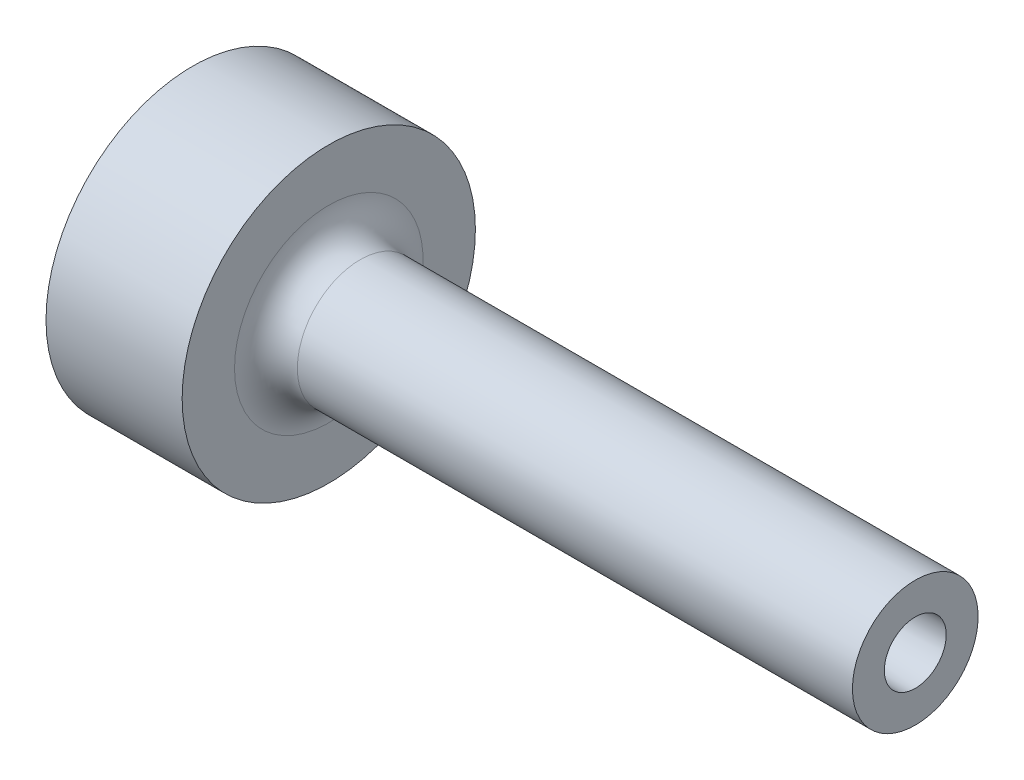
ISO-10303-21;
HEADER;
FILE_DESCRIPTION(('STEP AP214'),'2;1');
FILE_NAME('part.step','',(''),(''),'','','');
FILE_SCHEMA(('AUTOMOTIVE_DESIGN { 1 0 10303 214 1 1 1 1 }'));
ENDSEC;
DATA;
#1=APPLICATION_CONTEXT('core data for automotive mechanical design processes');
#2=APPLICATION_PROTOCOL_DEFINITION('international standard','automotive_design',2000,#1);
#3=PRODUCT_CONTEXT('',#1,'mechanical');
#4=PRODUCT('Part','Part','',(#3));
#5=PRODUCT_RELATED_PRODUCT_CATEGORY('part','',(#4));
#6=PRODUCT_DEFINITION_FORMATION('','',#4);
#7=PRODUCT_DEFINITION_CONTEXT('part definition',#1,'design');
#8=PRODUCT_DEFINITION('design','',#6,#7);
#9=PRODUCT_DEFINITION_SHAPE('','',#8);
#10=(LENGTH_UNIT() NAMED_UNIT(*) SI_UNIT(.MILLI.,.METRE.));
#11=(NAMED_UNIT(*) PLANE_ANGLE_UNIT() SI_UNIT($,.RADIAN.));
#12=(NAMED_UNIT(*) SI_UNIT($,.STERADIAN.) SOLID_ANGLE_UNIT());
#13=UNCERTAINTY_MEASURE_WITH_UNIT(LENGTH_MEASURE(1.E-05),#10,'distance_accuracy_value','');
#14=(GEOMETRIC_REPRESENTATION_CONTEXT(3) GLOBAL_UNCERTAINTY_ASSIGNED_CONTEXT((#13)) GLOBAL_UNIT_ASSIGNED_CONTEXT((#10,
#11,#12)) REPRESENTATION_CONTEXT('',''));
#15=CARTESIAN_POINT('',(0.,0.,0.));
#16=DIRECTION('',(0.,0.,1.));
#17=DIRECTION('',(1.,0.,0.));
#18=AXIS2_PLACEMENT_3D('',#15,#16,#17);
#19=CARTESIAN_POINT('',(0.,0.,0.));
#20=DIRECTION('',(-1.,0.,0.));
#21=DIRECTION('',(0.,0.,1.));
#22=AXIS2_PLACEMENT_3D('',#19,#20,#21);
#23=CYLINDRICAL_SURFACE('',#22,14.);
#24=CARTESIAN_POINT('',(13.,0.,0.));
#25=DIRECTION('',(-1.,0.,0.));
#26=DIRECTION('',(0.,0.,1.));
#27=AXIS2_PLACEMENT_3D('',#24,#25,#26);
#28=CIRCLE('',#27,14.);
#29=CARTESIAN_POINT('',(13.,0.,14.));
#30=VERTEX_POINT('',#29);
#31=EDGE_CURVE('E89',#30,#30,#28,.T.);
#32=ORIENTED_EDGE('',*,*,#31,.T.);
#33=EDGE_LOOP('',(#32));
#34=FACE_BOUND('',#33,.T.);
#35=CARTESIAN_POINT('',(0.,0.,0.));
#36=DIRECTION('',(-1.,0.,0.));
#37=DIRECTION('',(0.,0.,1.));
#38=AXIS2_PLACEMENT_3D('',#35,#36,#37);
#39=CIRCLE('',#38,14.);
#40=CARTESIAN_POINT('',(0.,0.,14.));
#41=VERTEX_POINT('',#40);
#42=EDGE_CURVE('E84',#41,#41,#39,.T.);
#43=ORIENTED_EDGE('',*,*,#42,.F.);
#44=EDGE_LOOP('',(#43));
#45=FACE_BOUND('',#44,.T.);
#46=CARTESIAN_POINT('',(6.5,-13.856406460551,-2.));
#47=CARTESIAN_POINT('',(6.61172417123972,-13.8564082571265,-1.99999534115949));
#48=CARTESIAN_POINT('',(6.72351471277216,-13.8577723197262,-1.99060664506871));
#49=CARTESIAN_POINT('',(6.9439746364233,-13.8630779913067,-1.95330740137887));
#50=CARTESIAN_POINT('',(7.05264079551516,-13.8670221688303,-1.92537839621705));
#51=CARTESIAN_POINT('',(7.26362870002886,-13.8770324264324,-1.85184738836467));
#52=CARTESIAN_POINT('',(7.36595507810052,-13.8830969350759,-1.80625847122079));
#53=CARTESIAN_POINT('',(7.56148972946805,-13.8966626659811,-1.69873175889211));
#54=CARTESIAN_POINT('',(7.65469934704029,-13.9041636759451,-1.63679637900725));
#55=CARTESIAN_POINT('',(7.83004829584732,-13.9198182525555,-1.49785346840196));
#56=CARTESIAN_POINT('',(7.91211171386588,-13.9279757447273,-1.42075056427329));
#57=CARTESIAN_POINT('',(8.06218155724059,-13.9439890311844,-1.25386707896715));
#58=CARTESIAN_POINT('',(8.13018723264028,-13.9518448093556,-1.16408582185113));
#59=CARTESIAN_POINT('',(8.25048909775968,-13.9664103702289,-0.973910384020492));
#60=CARTESIAN_POINT('',(8.30271571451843,-13.9731150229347,-0.873471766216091));
#61=CARTESIAN_POINT('',(8.38953073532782,-13.9845795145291,-0.665136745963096));
#62=CARTESIAN_POINT('',(8.4241199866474,-13.9893394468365,-0.557240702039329));
#63=CARTESIAN_POINT('',(8.47444920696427,-13.9963505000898,-0.337834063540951));
#64=CARTESIAN_POINT('',(8.49031606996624,-13.9986185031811,-0.226353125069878));
#65=CARTESIAN_POINT('',(8.5031438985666,-14.0004479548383,-0.00228956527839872));
#66=CARTESIAN_POINT('',(8.50010582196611,-14.0000095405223,0.110292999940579));
#67=CARTESIAN_POINT('',(8.47531062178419,-13.9964890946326,0.33249899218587));
#68=CARTESIAN_POINT('',(8.45369000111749,-13.9934263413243,0.442137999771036));
#69=CARTESIAN_POINT('',(8.39255744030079,-13.9850228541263,0.656215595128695));
#70=CARTESIAN_POINT('',(8.3530450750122,-13.9796820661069,0.760654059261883));
#71=CARTESIAN_POINT('',(8.25710925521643,-13.9672894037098,0.961781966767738));
#72=CARTESIAN_POINT('',(8.20062784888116,-13.9602316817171,1.05844339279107));
#73=CARTESIAN_POINT('',(8.07239950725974,-13.9451926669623,1.24096782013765));
#74=CARTESIAN_POINT('',(8.00065165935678,-13.9372113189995,1.32683017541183));
#75=CARTESIAN_POINT('',(7.843165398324,-13.921132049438,1.48612299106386));
#76=CARTESIAN_POINT('',(7.75730786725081,-13.9130337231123,1.55943569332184));
#77=CARTESIAN_POINT('',(7.57444547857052,-13.8977029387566,1.69062989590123));
#78=CARTESIAN_POINT('',(7.47744056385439,-13.890470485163,1.74851131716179));
#79=CARTESIAN_POINT('',(7.27491971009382,-13.8776905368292,1.84721301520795));
#80=CARTESIAN_POINT('',(7.1693981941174,-13.8721441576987,1.88802200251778));
#81=CARTESIAN_POINT('',(6.95290242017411,-13.8633846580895,1.9513062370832));
#82=CARTESIAN_POINT('',(6.84192850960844,-13.8601713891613,1.97378265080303));
#83=CARTESIAN_POINT('',(6.61872346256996,-13.8564698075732,1.99960390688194));
#84=CARTESIAN_POINT('',(6.50651197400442,-13.8559577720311,2.00311531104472));
#85=CARTESIAN_POINT('',(6.28310219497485,-13.8576537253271,1.9913480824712));
#86=CARTESIAN_POINT('',(6.17190387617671,-13.8598616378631,1.9760699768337));
#87=CARTESIAN_POINT('',(5.95418781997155,-13.8667269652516,1.92729837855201));
#88=CARTESIAN_POINT('',(5.84765127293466,-13.8713733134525,1.8938871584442));
#89=CARTESIAN_POINT('',(5.6416912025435,-13.8825829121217,1.80988306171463));
#90=CARTESIAN_POINT('',(5.54226800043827,-13.8891462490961,1.75928940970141));
#91=CARTESIAN_POINT('',(5.35260812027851,-13.9035064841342,1.64195360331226));
#92=CARTESIAN_POINT('',(5.26243903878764,-13.911311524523,1.57510320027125));
#93=CARTESIAN_POINT('',(5.09454027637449,-13.9272509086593,1.42730277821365));
#94=CARTESIAN_POINT('',(5.01681123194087,-13.9353852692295,1.34635203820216));
#95=CARTESIAN_POINT('',(4.8754047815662,-13.9511405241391,1.17191708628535));
#96=CARTESIAN_POINT('',(4.81183747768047,-13.9587570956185,1.07834317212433));
#97=CARTESIAN_POINT('',(4.70132443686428,-13.972552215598,0.881748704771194));
#98=CARTESIAN_POINT('',(4.65437828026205,-13.9787308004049,0.778728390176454));
#99=CARTESIAN_POINT('',(4.57861788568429,-13.9889347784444,0.566515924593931));
#100=CARTESIAN_POINT('',(4.54974241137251,-13.9929674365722,0.457345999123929));
#101=CARTESIAN_POINT('',(4.51074453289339,-13.9984555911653,0.235645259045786));
#102=CARTESIAN_POINT('',(4.50062101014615,-13.9999112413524,0.123114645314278));
#103=CARTESIAN_POINT('',(4.49943976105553,-14.0000800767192,-0.101043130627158));
#104=CARTESIAN_POINT('',(4.50821318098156,-13.998817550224,-0.212669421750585));
#105=CARTESIAN_POINT('',(4.54421615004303,-13.9937406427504,-0.432842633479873));
#106=CARTESIAN_POINT('',(4.57144565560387,-13.989926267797,-0.541389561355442));
#107=CARTESIAN_POINT('',(4.6435299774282,-13.9801722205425,-0.752283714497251));
#108=CARTESIAN_POINT('',(4.68837418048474,-13.9742338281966,-0.854634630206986));
#109=CARTESIAN_POINT('',(4.79439714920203,-13.960885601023,-1.05038570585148));
#110=CARTESIAN_POINT('',(4.8555763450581,-13.9534757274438,-1.14378562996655));
#111=CARTESIAN_POINT('',(4.99314771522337,-13.9379304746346,-1.31984194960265));
#112=CARTESIAN_POINT('',(5.06966490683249,-13.9297894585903,-1.40240016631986));
#113=CARTESIAN_POINT('',(5.2354775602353,-13.9137422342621,-1.55356716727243));
#114=CARTESIAN_POINT('',(5.32477602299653,-13.9058360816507,-1.6221726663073));
#115=CARTESIAN_POINT('',(5.51414543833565,-13.8911108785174,-1.74379523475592));
#116=CARTESIAN_POINT('',(5.61426869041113,-13.8842975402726,-1.79673154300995));
#117=CARTESIAN_POINT('',(5.82203229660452,-13.8725962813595,-1.88495902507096));
#118=CARTESIAN_POINT('',(5.92966459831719,-13.8677063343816,-1.92026877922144));
#119=CARTESIAN_POINT('',(6.11483642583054,-13.8615529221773,-1.96409255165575));
#120=CARTESIAN_POINT('',(6.19122433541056,-13.859633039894,-1.97753762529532));
#121=CARTESIAN_POINT('',(6.34506419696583,-13.857059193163,-1.99549291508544));
#122=CARTESIAN_POINT('',(6.42251613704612,-13.8564052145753,-2.00000323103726));
#123=CARTESIAN_POINT('',(6.5,-13.856406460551,-2.));
#124=B_SPLINE_CURVE_WITH_KNOTS('',3,(#46,#47,#48,#49,#50,#51,#52,#53,#54,#55,#56,#57,#58,#59,
#60,#61,#62,#63,#64,#65,#66,#67,#68,#69,#70,#71,#72,#73,#74,#75,#76,#77,#78,#79,#80,#81,#82,#83,
#84,#85,#86,#87,#88,#89,#90,#91,#92,#93,#94,#95,#96,#97,#98,#99,#100,#101,#102,#103,#104,#105,
#106,#107,#108,#109,#110,#111,#112,#113,#114,#115,#116,#117,#118,#119,#120,#121,#122,#123),
.UNSPECIFIED.,.T.,.F.,(4,2,2,2,2,2,2,2,2,2,2,2,2,2,2,2,2,2,2,2,2,2,2,2,2,2,2,2,2,2,2,2,2,2,2,2,
2,2,4),(0.,0.334889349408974,0.670112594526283,1.00508792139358,1.34001378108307,
1.6771171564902,2.01423851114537,2.35282530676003,2.6913958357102,3.02765822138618,
3.36390357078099,3.69769984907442,4.03150405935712,4.36646147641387,4.70143892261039,
5.03940517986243,5.37737316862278,5.7155642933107,6.05373389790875,6.3889286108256,
6.72411392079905,7.05779100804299,7.39148315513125,7.72746121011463,8.06345644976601,
8.40197921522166,8.74049343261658,9.07785422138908,9.41519488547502,9.74953375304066,
10.083871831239,10.4180087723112,10.7521545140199,11.0891434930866,11.426211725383,
11.7649881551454,12.103406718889,12.3356645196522,12.5679197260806),.UNSPECIFIED.);
#125=CARTESIAN_POINT('',(6.5,-13.856406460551,-2.));
#126=VERTEX_POINT('',#125);
#127=EDGE_CURVE('E10',#126,#126,#124,.T.);
#128=ORIENTED_EDGE('',*,*,#127,.F.);
#129=EDGE_LOOP('',(#128));
#130=FACE_BOUND('',#129,.T.);
#131=ADVANCED_FACE('F16',(#34,#45,#130),#23,.T.);
#132=CARTESIAN_POINT('',(0.,0.,0.));
#133=DIRECTION('',(1.,0.,0.));
#134=DIRECTION('',(0.,0.,-1.));
#135=AXIS2_PLACEMENT_3D('',#132,#133,#134);
#136=CONICAL_SURFACE('',#135,1.75,0.0174532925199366);
#137=CARTESIAN_POINT('',(69.,0.,0.));
#138=DIRECTION('',(-1.,0.,0.));
#139=DIRECTION('',(0.,0.,1.));
#140=AXIS2_PLACEMENT_3D('',#137,#138,#139);
#141=CIRCLE('',#140,2.95439948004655);
#142=CARTESIAN_POINT('',(69.,0.,2.95439948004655));
#143=VERTEX_POINT('',#142);
#144=EDGE_CURVE('E81',#143,#143,#141,.T.);
#145=ORIENTED_EDGE('',*,*,#144,.F.);
#146=EDGE_LOOP('',(#145));
#147=FACE_BOUND('',#146,.T.);
#148=CARTESIAN_POINT('',(1.08679639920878,0.,0.));
#149=DIRECTION('',(-1.,0.,0.));
#150=DIRECTION('',(0.,0.,1.));
#151=AXIS2_PLACEMENT_3D('',#148,#149,#150);
#152=CIRCLE('',#151,1.76897010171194);
#153=CARTESIAN_POINT('',(1.08679639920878,0.,1.76897010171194));
#154=VERTEX_POINT('',#153);
#155=EDGE_CURVE('E94',#154,#154,#152,.F.);
#156=ORIENTED_EDGE('',*,*,#155,.F.);
#157=EDGE_LOOP('',(#156));
#158=FACE_BOUND('',#157,.T.);
#159=ADVANCED_FACE('F45',(#147,#158),#136,.F.);
#160=CARTESIAN_POINT('',(16.,0.,0.));
#161=DIRECTION('',(-1.,0.,0.));
#162=DIRECTION('',(0.,0.,1.));
#163=AXIS2_PLACEMENT_3D('',#160,#161,#162);
#164=TOROIDAL_SURFACE('',#163,9.,3.);
#165=CARTESIAN_POINT('',(13.,0.,0.));
#166=DIRECTION('',(-1.,0.,0.));
#167=DIRECTION('',(0.,0.,1.));
#168=AXIS2_PLACEMENT_3D('',#165,#166,#167);
#169=CIRCLE('',#168,9.);
#170=CARTESIAN_POINT('',(13.,0.,9.));
#171=VERTEX_POINT('',#170);
#172=EDGE_CURVE('E91',#171,#171,#169,.T.);
#173=ORIENTED_EDGE('',*,*,#172,.F.);
#174=EDGE_LOOP('',(#173));
#175=FACE_BOUND('',#174,.T.);
#176=CARTESIAN_POINT('',(16.,0.,0.));
#177=DIRECTION('',(-1.,0.,0.));
#178=DIRECTION('',(0.,0.,1.));
#179=AXIS2_PLACEMENT_3D('',#176,#177,#178);
#180=CIRCLE('',#179,6.);
#181=CARTESIAN_POINT('',(16.,0.,6.));
#182=VERTEX_POINT('',#181);
#183=EDGE_CURVE('E28',#182,#182,#180,.T.);
#184=ORIENTED_EDGE('',*,*,#183,.T.);
#185=EDGE_LOOP('',(#184));
#186=FACE_BOUND('',#185,.T.);
#187=ADVANCED_FACE('F18',(#175,#186),#164,.F.);
#188=CARTESIAN_POINT('',(0.,0.,0.));
#189=DIRECTION('',(-1.,0.,0.));
#190=DIRECTION('',(0.,0.,1.));
#191=AXIS2_PLACEMENT_3D('',#188,#189,#190);
#192=CYLINDRICAL_SURFACE('',#191,6.);
#193=ORIENTED_EDGE('',*,*,#183,.F.);
#194=EDGE_LOOP('',(#193));
#195=FACE_BOUND('',#194,.T.);
#196=CARTESIAN_POINT('',(69.,0.,0.));
#197=DIRECTION('',(-1.,0.,0.));
#198=DIRECTION('',(0.,0.,1.));
#199=AXIS2_PLACEMENT_3D('',#196,#197,#198);
#200=CIRCLE('',#199,6.);
#201=CARTESIAN_POINT('',(69.,0.,6.));
#202=VERTEX_POINT('',#201);
#203=EDGE_CURVE('E80',#202,#202,#200,.T.);
#204=ORIENTED_EDGE('',*,*,#203,.T.);
#205=EDGE_LOOP('',(#204));
#206=FACE_BOUND('',#205,.T.);
#207=ADVANCED_FACE('F66',(#195,#206),#192,.T.);
#208=CARTESIAN_POINT('',(69.,6.,0.));
#209=DIRECTION('',(-1.,0.,0.));
#210=DIRECTION('',(0.,0.,1.));
#211=AXIS2_PLACEMENT_3D('',#208,#209,#210);
#212=PLANE('',#211);
#213=ORIENTED_EDGE('',*,*,#203,.F.);
#214=EDGE_LOOP('',(#213));
#215=FACE_BOUND('',#214,.T.);
#216=ORIENTED_EDGE('',*,*,#144,.T.);
#217=EDGE_LOOP('',(#216));
#218=FACE_BOUND('',#217,.T.);
#219=ADVANCED_FACE('F62',(#215,#218),#212,.F.);
#220=CARTESIAN_POINT('',(0.,1.75,0.));
#221=DIRECTION('',(1.,0.,0.));
#222=DIRECTION('',(0.,0.,-1.));
#223=AXIS2_PLACEMENT_3D('',#220,#221,#222);
#224=PLANE('',#223);
#225=CARTESIAN_POINT('',(0.,0.,0.));
#226=DIRECTION('',(-1.,0.,0.));
#227=DIRECTION('',(0.,0.,1.));
#228=AXIS2_PLACEMENT_3D('',#225,#226,#227);
#229=CIRCLE('',#228,5.);
#230=CARTESIAN_POINT('',(0.,0.,5.));
#231=VERTEX_POINT('',#230);
#232=EDGE_CURVE('E97',#231,#231,#229,.T.);
#233=ORIENTED_EDGE('',*,*,#232,.F.);
#234=EDGE_LOOP('',(#233));
#235=FACE_BOUND('',#234,.T.);
#236=ORIENTED_EDGE('',*,*,#42,.T.);
#237=EDGE_LOOP('',(#236));
#238=FACE_BOUND('',#237,.T.);
#239=ADVANCED_FACE('F60',(#235,#238),#224,.F.);
#240=CARTESIAN_POINT('',(13.,14.,0.));
#241=DIRECTION('',(-1.,0.,0.));
#242=DIRECTION('',(0.,0.,1.));
#243=AXIS2_PLACEMENT_3D('',#240,#241,#242);
#244=PLANE('',#243);
#245=ORIENTED_EDGE('',*,*,#31,.F.);
#246=EDGE_LOOP('',(#245));
#247=FACE_BOUND('',#246,.T.);
#248=ORIENTED_EDGE('',*,*,#172,.T.);
#249=EDGE_LOOP('',(#248));
#250=FACE_BOUND('',#249,.T.);
#251=ADVANCED_FACE('F58',(#247,#250),#244,.F.);
#252=CARTESIAN_POINT('',(-37.3349076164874,0.,0.));
#253=DIRECTION('',(-1.,0.,0.));
#254=DIRECTION('',(0.,0.,1.));
#255=AXIS2_PLACEMENT_3D('',#252,#253,#254);
#256=DEGENERATE_TOROIDAL_SURFACE('',#255,9.35634609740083,40.,.F.);
#257=ORIENTED_EDGE('',*,*,#232,.T.);
#258=EDGE_LOOP('',(#257));
#259=FACE_BOUND('',#258,.T.);
#260=ORIENTED_EDGE('',*,*,#155,.T.);
#261=EDGE_LOOP('',(#260));
#262=FACE_BOUND('',#261,.T.);
#263=ADVANCED_FACE('F41',(#259,#262),#256,.T.);
#264=CARTESIAN_POINT('',(6.5,-14.,0.));
#265=DIRECTION('',(0.,-1.,0.));
#266=DIRECTION('',(0.,0.,-1.));
#267=AXIS2_PLACEMENT_3D('',#264,#265,#266);
#268=CYLINDRICAL_SURFACE('',#267,2.);
#269=CARTESIAN_POINT('',(6.5,-8.,0.));
#270=DIRECTION('',(0.,-1.,0.));
#271=DIRECTION('',(0.,0.,-1.));
#272=AXIS2_PLACEMENT_3D('',#269,#270,#271);
#273=CIRCLE('',#272,2.);
#274=CARTESIAN_POINT('',(6.5,-8.,-2.));
#275=VERTEX_POINT('',#274);
#276=EDGE_CURVE('E100',#275,#275,#273,.T.);
#277=ORIENTED_EDGE('',*,*,#276,.F.);
#278=EDGE_LOOP('',(#277));
#279=FACE_BOUND('',#278,.T.);
#280=ORIENTED_EDGE('',*,*,#127,.T.);
#281=EDGE_LOOP('',(#280));
#282=FACE_BOUND('',#281,.T.);
#283=ADVANCED_FACE('F33',(#279,#282),#268,.F.);
#284=CARTESIAN_POINT('',(6.5,-6.84529946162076,0.));
#285=DIRECTION('',(0.,-1.,0.));
#286=DIRECTION('',(0.,0.,-1.));
#287=AXIS2_PLACEMENT_3D('',#284,#285,#286);
#288=CONICAL_SURFACE('',#287,0.,1.0471975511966);
#289=ORIENTED_EDGE('',*,*,#276,.T.);
#290=EDGE_LOOP('',(#289));
#291=FACE_BOUND('',#290,.T.);
#292=CARTESIAN_POINT('',(6.5,-6.84529946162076,0.));
#293=VERTEX_POINT('',#292);
#294=VERTEX_LOOP('',#293);
#295=FACE_BOUND('',#294,.T.);
#296=ADVANCED_FACE('F31',(#291,#295),#288,.F.);
#297=CLOSED_SHELL('',(#131,#159,#187,#207,#219,#239,#251,#263,#283,#296));
#298=MANIFOLD_SOLID_BREP('B1',#297);
#299=ADVANCED_BREP_SHAPE_REPRESENTATION('',(#18,#298),#14);
#300=SHAPE_DEFINITION_REPRESENTATION(#9,#299);
ENDSEC;
END-ISO-10303-21;
